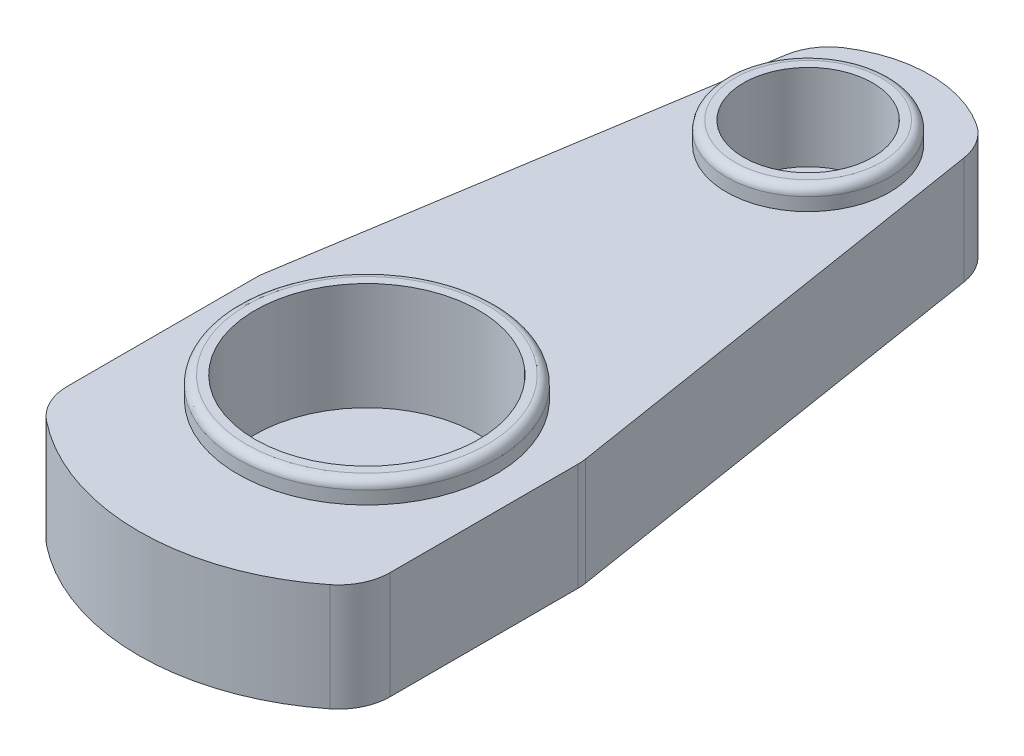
from build123d import *

# Parameters (mm, degrees)
SALIENTE_EXTRUIR1_DEPTH = 25
CROQUIS2_R              = 30
SALIENTE_EXTRUIR2_DEPTH = 5
CROQUIS3_R              = 26
CORTAR_EXTRUIR1_DEPTH   = 25
REDONDEO1_R             = 2
CROQUIS4_R              = 19
SALIENTE_EXTRUIR3_DEPTH = 5
CROQUIS5_R              = 15
CORTAR_EXTRUIR2_DEPTH   = 20
REDONDEO2_R             = 2
REDONDEO3_R             = 12


with BuildPart() as part:
    # Croquis1 → Saliente-Extruir1 (new body)
    with BuildSketch(Plane(origin=(0, 0, 0), x_dir=(1, 0, 0), z_dir=(0, 1, 0))):
        with BuildLine():
            Line((-37.5, -75), (-37.5, -25))
            Line((-37.5, -25), (-20, 85))
            ThreePointArc((-20, 85), (0, 93.284271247), (20, 85))
            Line((20, 85), (37.5, -25))
            Line((37.5, -25), (37.5, -75))
            ThreePointArc((37.5, -75), (0, -90.54669574), (-37.5, -75))
        make_face()
    extrude(amount=SALIENTE_EXTRUIR1_DEPTH)

    # Croquis2 → Saliente-Extruir2 (add)
    with BuildSketch(Plane(origin=(0, 25, 0), x_dir=(1, 0, 0), z_dir=(0, 1, 0))):
        with Locations(Location((0, -37.54669574, 0), (0, 0, 90))):
            Circle(CROQUIS2_R)
    extrude(amount=SALIENTE_EXTRUIR2_DEPTH)

    # Croquis3 → Cortar-Extruir1 (cut)
    with BuildSketch(Plane(origin=(0, 30, 0), x_dir=(1, 0, 0), z_dir=(0, 1, 0))):
        with Locations(Location((0, -37.54669574, 0), (0, 0, 270))):
            Circle(CROQUIS3_R)
    extrude(amount=-CORTAR_EXTRUIR1_DEPTH, mode=Mode.SUBTRACT)

    # Redondeo1
    redondeo1_edges = [part.edges().sort_by_distance(p)[0] for p in [
        (0, 30, 67.54669574),
    ]]
    fillet(redondeo1_edges, radius=REDONDEO1_R)

    # Croquis4 → Saliente-Extruir3 (add)
    with BuildSketch(Plane(origin=(0, 25, 0), x_dir=(1, 0, 0), z_dir=(0, 1, 0))):
        with Locations(Location((0, 65, 0), (0, 0, 90))):
            Circle(CROQUIS4_R)
    extrude(amount=SALIENTE_EXTRUIR3_DEPTH)

    # Croquis5 → Cortar-Extruir2 (cut)
    with BuildSketch(Plane(origin=(0, 30, 0), x_dir=(1, 0, 0), z_dir=(0, 1, 0))):
        with Locations(Location((0, 65, 0), (0, 0, 270))):
            Circle(CROQUIS5_R)
    extrude(amount=-CORTAR_EXTRUIR2_DEPTH, mode=Mode.SUBTRACT)

    # Redondeo2
    redondeo2_edges = [part.edges().sort_by_distance(p)[0] for p in [
        (0, 30, -46),
    ]]
    fillet(redondeo2_edges, radius=REDONDEO2_R)

    # Redondeo3
    redondeo3_edges = [part.edges().sort_by_distance(p)[0] for p in [
        (-37.5, 12.5, 75),
        (-37.5, 12.5, 25),
        (-20, 12.5, -85),
        (20, 12.5, -85),
        (37.5, 12.5, 25),
        (37.5, 12.5, 75),
    ]]
    fillet(redondeo3_edges, radius=REDONDEO3_R)


solid = part.part
